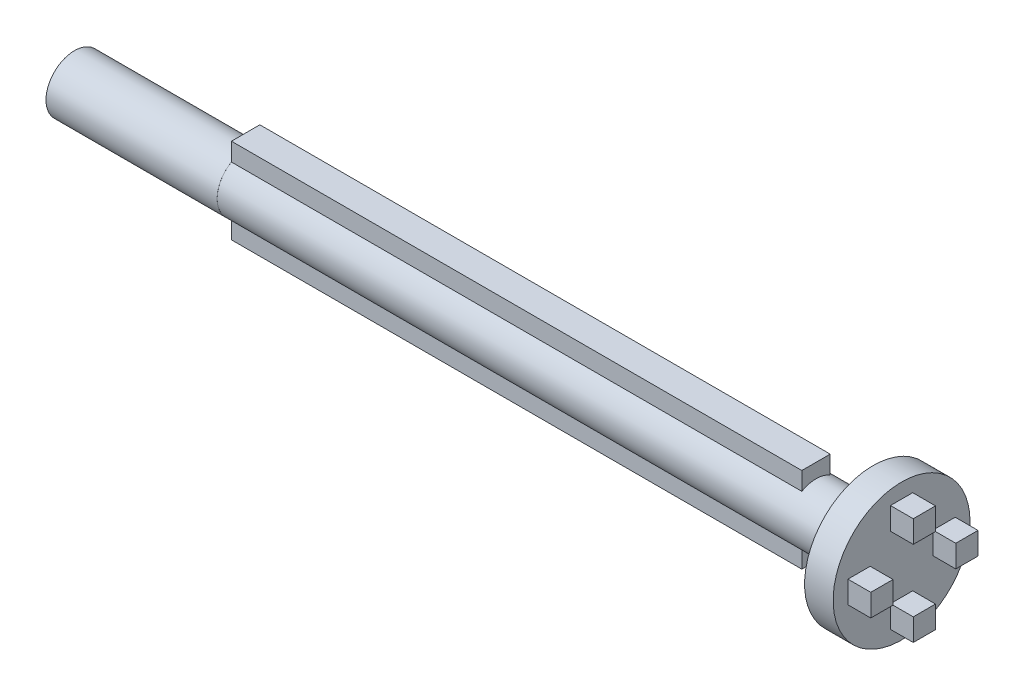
ISO-10303-21;
HEADER;
FILE_DESCRIPTION(('STEP AP214'),'2;1');
FILE_NAME('part.step','',(''),(''),'','','');
FILE_SCHEMA(('AUTOMOTIVE_DESIGN { 1 0 10303 214 1 1 1 1 }'));
ENDSEC;
DATA;
#1=APPLICATION_CONTEXT('core data for automotive mechanical design processes');
#2=APPLICATION_PROTOCOL_DEFINITION('international standard','automotive_design',2000,#1);
#3=PRODUCT_CONTEXT('',#1,'mechanical');
#4=PRODUCT('Part','Part','',(#3));
#5=PRODUCT_RELATED_PRODUCT_CATEGORY('part','',(#4));
#6=PRODUCT_DEFINITION_FORMATION('','',#4);
#7=PRODUCT_DEFINITION_CONTEXT('part definition',#1,'design');
#8=PRODUCT_DEFINITION('design','',#6,#7);
#9=PRODUCT_DEFINITION_SHAPE('','',#8);
#10=(LENGTH_UNIT() NAMED_UNIT(*) SI_UNIT(.MILLI.,.METRE.));
#11=(NAMED_UNIT(*) PLANE_ANGLE_UNIT() SI_UNIT($,.RADIAN.));
#12=(NAMED_UNIT(*) SI_UNIT($,.STERADIAN.) SOLID_ANGLE_UNIT());
#13=UNCERTAINTY_MEASURE_WITH_UNIT(LENGTH_MEASURE(1.E-05),#10,'distance_accuracy_value','');
#14=(GEOMETRIC_REPRESENTATION_CONTEXT(3) GLOBAL_UNCERTAINTY_ASSIGNED_CONTEXT((#13)) GLOBAL_UNIT_ASSIGNED_CONTEXT((#10,
#11,#12)) REPRESENTATION_CONTEXT('',''));
#15=CARTESIAN_POINT('',(0.,0.,0.));
#16=DIRECTION('',(0.,0.,1.));
#17=DIRECTION('',(1.,0.,0.));
#18=AXIS2_PLACEMENT_3D('',#15,#16,#17);
#19=CARTESIAN_POINT('',(0.,0.,0.));
#20=DIRECTION('',(1.,0.,0.));
#21=DIRECTION('',(0.,0.,-1.));
#22=AXIS2_PLACEMENT_3D('',#19,#20,#21);
#23=PLANE('',#22);
#24=CARTESIAN_POINT('',(0.,0.,0.));
#25=DIRECTION('',(-1.,0.,0.));
#26=DIRECTION('',(0.,0.,1.));
#27=AXIS2_PLACEMENT_3D('',#24,#25,#26);
#28=CIRCLE('',#27,5.);
#29=CARTESIAN_POINT('',(0.,4.33588514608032,2.49));
#30=VERTEX_POINT('',#29);
#31=CARTESIAN_POINT('',(0.,4.33588514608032,-2.49));
#32=VERTEX_POINT('',#31);
#33=EDGE_CURVE('E53',#30,#32,#28,.T.);
#34=ORIENTED_EDGE('',*,*,#33,.F.);
#35=DIRECTION('',(0.,-1.,0.));
#36=VECTOR('',#35,1.);
#37=CARTESIAN_POINT('',(0.,0.,2.49));
#38=LINE('',#37,#36);
#39=CARTESIAN_POINT('',(0.,7.49,2.49));
#40=VERTEX_POINT('',#39);
#41=EDGE_CURVE('E292',#40,#30,#38,.T.);
#42=ORIENTED_EDGE('',*,*,#41,.F.);
#43=DIRECTION('',(0.,0.,-1.));
#44=VECTOR('',#43,1.);
#45=CARTESIAN_POINT('',(0.,7.49,0.));
#46=LINE('',#45,#44);
#47=CARTESIAN_POINT('',(0.,7.49,-2.49));
#48=VERTEX_POINT('',#47);
#49=EDGE_CURVE('E288',#40,#48,#46,.T.);
#50=ORIENTED_EDGE('',*,*,#49,.T.);
#51=DIRECTION('',(0.,-1.,0.));
#52=VECTOR('',#51,1.);
#53=CARTESIAN_POINT('',(0.,0.,-2.49));
#54=LINE('',#53,#52);
#55=EDGE_CURVE('E286',#48,#32,#54,.T.);
#56=ORIENTED_EDGE('',*,*,#55,.T.);
#57=EDGE_LOOP('',(#34,#42,#50,#56));
#58=FACE_BOUND('',#57,.T.);
#59=ADVANCED_FACE('F43',(#58),#23,.F.);
#60=CARTESIAN_POINT('',(115.,0.,0.));
#61=DIRECTION('',(1.,0.,0.));
#62=DIRECTION('',(0.,0.,-1.));
#63=AXIS2_PLACEMENT_3D('',#60,#61,#62);
#64=PLANE('',#63);
#65=DIRECTION('',(0.,1.,0.));
#66=VECTOR('',#65,1.);
#67=CARTESIAN_POINT('',(115.,0.,1.95));
#68=LINE('',#67,#66);
#69=CARTESIAN_POINT('',(115.,-9.4,1.95));
#70=VERTEX_POINT('',#69);
#71=CARTESIAN_POINT('',(115.,-5.5,1.95));
#72=VERTEX_POINT('',#71);
#73=EDGE_CURVE('E350',#70,#72,#68,.T.);
#74=ORIENTED_EDGE('',*,*,#73,.T.);
#75=DIRECTION('',(0.,0.,-1.));
#76=VECTOR('',#75,1.);
#77=CARTESIAN_POINT('',(115.,-5.5,0.));
#78=LINE('',#77,#76);
#79=CARTESIAN_POINT('',(115.,-5.5,-1.95));
#80=VERTEX_POINT('',#79);
#81=EDGE_CURVE('E355',#72,#80,#78,.T.);
#82=ORIENTED_EDGE('',*,*,#81,.T.);
#83=DIRECTION('',(0.,1.,0.));
#84=VECTOR('',#83,1.);
#85=CARTESIAN_POINT('',(115.,0.,-1.95));
#86=LINE('',#85,#84);
#87=CARTESIAN_POINT('',(115.,-9.4,-1.95));
#88=VERTEX_POINT('',#87);
#89=EDGE_CURVE('E367',#88,#80,#86,.T.);
#90=ORIENTED_EDGE('',*,*,#89,.F.);
#91=DIRECTION('',(0.,0.,-1.));
#92=VECTOR('',#91,1.);
#93=CARTESIAN_POINT('',(115.,-9.4,0.));
#94=LINE('',#93,#92);
#95=EDGE_CURVE('E364',#70,#88,#94,.T.);
#96=ORIENTED_EDGE('',*,*,#95,.F.);
#97=EDGE_LOOP('',(#74,#82,#90,#96));
#98=FACE_BOUND('',#97,.T.);
#99=DIRECTION('',(0.,-1.,0.));
#100=VECTOR('',#99,1.);
#101=CARTESIAN_POINT('',(115.,0.,-1.95));
#102=LINE('',#101,#100);
#103=CARTESIAN_POINT('',(115.,9.4,-1.95));
#104=VERTEX_POINT('',#103);
#105=CARTESIAN_POINT('',(115.,5.5,-1.95));
#106=VERTEX_POINT('',#105);
#107=EDGE_CURVE('E415',#104,#106,#102,.T.);
#108=ORIENTED_EDGE('',*,*,#107,.T.);
#109=DIRECTION('',(0.,0.,-1.));
#110=VECTOR('',#109,1.);
#111=CARTESIAN_POINT('',(115.,5.5,0.));
#112=LINE('',#111,#110);
#113=CARTESIAN_POINT('',(115.,5.5,1.95));
#114=VERTEX_POINT('',#113);
#115=EDGE_CURVE('E420',#114,#106,#112,.T.);
#116=ORIENTED_EDGE('',*,*,#115,.F.);
#117=DIRECTION('',(0.,-1.,0.));
#118=VECTOR('',#117,1.);
#119=CARTESIAN_POINT('',(115.,0.,1.95));
#120=LINE('',#119,#118);
#121=CARTESIAN_POINT('',(115.,9.4,1.95));
#122=VERTEX_POINT('',#121);
#123=EDGE_CURVE('E433',#122,#114,#120,.T.);
#124=ORIENTED_EDGE('',*,*,#123,.F.);
#125=DIRECTION('',(0.,0.,-1.));
#126=VECTOR('',#125,1.);
#127=CARTESIAN_POINT('',(115.,9.4,0.));
#128=LINE('',#127,#126);
#129=EDGE_CURVE('E430',#122,#104,#128,.T.);
#130=ORIENTED_EDGE('',*,*,#129,.T.);
#131=EDGE_LOOP('',(#108,#116,#124,#130));
#132=FACE_BOUND('',#131,.T.);
#133=CARTESIAN_POINT('',(115.,0.,0.));
#134=DIRECTION('',(1.,0.,0.));
#135=DIRECTION('',(0.,0.,-1.));
#136=AXIS2_PLACEMENT_3D('',#133,#134,#135);
#137=CIRCLE('',#136,12.);
#138=CARTESIAN_POINT('',(115.,0.,-12.));
#139=VERTEX_POINT('',#138);
#140=EDGE_CURVE('E271',#139,#139,#137,.T.);
#141=ORIENTED_EDGE('',*,*,#140,.T.);
#142=EDGE_LOOP('',(#141));
#143=FACE_BOUND('',#142,.T.);
#144=DIRECTION('',(0.,1.,0.));
#145=VECTOR('',#144,1.);
#146=CARTESIAN_POINT('',(115.,0.,5.49999999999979));
#147=LINE('',#146,#145);
#148=CARTESIAN_POINT('',(115.,-1.9500000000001,5.49999999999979));
#149=VERTEX_POINT('',#148);
#150=CARTESIAN_POINT('',(115.,1.9499999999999,5.49999999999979));
#151=VERTEX_POINT('',#150);
#152=EDGE_CURVE('E398',#149,#151,#147,.T.);
#153=ORIENTED_EDGE('',*,*,#152,.F.);
#154=DIRECTION('',(0.,0.,-1.));
#155=VECTOR('',#154,1.);
#156=CARTESIAN_POINT('',(115.,-1.9500000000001,0.));
#157=LINE('',#156,#155);
#158=CARTESIAN_POINT('',(115.,-1.9500000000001,9.39999999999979));
#159=VERTEX_POINT('',#158);
#160=EDGE_CURVE('E382',#159,#149,#157,.T.);
#161=ORIENTED_EDGE('',*,*,#160,.F.);
#162=DIRECTION('',(0.,1.,0.));
#163=VECTOR('',#162,1.);
#164=CARTESIAN_POINT('',(115.,0.,9.39999999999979));
#165=LINE('',#164,#163);
#166=CARTESIAN_POINT('',(115.,1.9499999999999,9.39999999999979));
#167=VERTEX_POINT('',#166);
#168=EDGE_CURVE('E387',#159,#167,#165,.T.);
#169=ORIENTED_EDGE('',*,*,#168,.T.);
#170=DIRECTION('',(0.,0.,-1.));
#171=VECTOR('',#170,1.);
#172=CARTESIAN_POINT('',(115.,1.9499999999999,0.));
#173=LINE('',#172,#171);
#174=EDGE_CURVE('E401',#167,#151,#173,.T.);
#175=ORIENTED_EDGE('',*,*,#174,.T.);
#176=EDGE_LOOP('',(#153,#161,#169,#175));
#177=FACE_BOUND('',#176,.T.);
#178=DIRECTION('',(0.,-1.,0.));
#179=VECTOR('',#178,1.);
#180=CARTESIAN_POINT('',(115.,0.,-5.5000000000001));
#181=LINE('',#180,#179);
#182=CARTESIAN_POINT('',(115.,1.95000000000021,-5.5000000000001));
#183=VERTEX_POINT('',#182);
#184=CARTESIAN_POINT('',(115.,-1.94999999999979,-5.5000000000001));
#185=VERTEX_POINT('',#184);
#186=EDGE_CURVE('E333',#183,#185,#181,.T.);
#187=ORIENTED_EDGE('',*,*,#186,.F.);
#188=DIRECTION('',(0.,0.,1.));
#189=VECTOR('',#188,1.);
#190=CARTESIAN_POINT('',(115.,1.95000000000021,0.));
#191=LINE('',#190,#189);
#192=CARTESIAN_POINT('',(115.,1.95000000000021,-9.4000000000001));
#193=VERTEX_POINT('',#192);
#194=EDGE_CURVE('E314',#193,#183,#191,.T.);
#195=ORIENTED_EDGE('',*,*,#194,.F.);
#196=DIRECTION('',(0.,-1.,0.));
#197=VECTOR('',#196,1.);
#198=CARTESIAN_POINT('',(115.,0.,-9.4000000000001));
#199=LINE('',#198,#197);
#200=CARTESIAN_POINT('',(115.,-1.94999999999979,-9.4000000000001));
#201=VERTEX_POINT('',#200);
#202=EDGE_CURVE('E322',#193,#201,#199,.T.);
#203=ORIENTED_EDGE('',*,*,#202,.T.);
#204=DIRECTION('',(0.,0.,1.));
#205=VECTOR('',#204,1.);
#206=CARTESIAN_POINT('',(115.,-1.94999999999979,0.));
#207=LINE('',#206,#205);
#208=EDGE_CURVE('E336',#201,#185,#207,.T.);
#209=ORIENTED_EDGE('',*,*,#208,.T.);
#210=EDGE_LOOP('',(#187,#195,#203,#209));
#211=FACE_BOUND('',#210,.T.);
#212=ADVANCED_FACE('F466',(#98,#132,#143,#177,#211),#64,.T.);
#213=CARTESIAN_POINT('',(110.,0.,2.49));
#214=DIRECTION('',(0.,0.,-1.));
#215=DIRECTION('',(0.,1.,0.));
#216=AXIS2_PLACEMENT_3D('',#213,#214,#215);
#217=PLANE('',#216);
#218=DIRECTION('',(-1.,0.,0.));
#219=VECTOR('',#218,1.);
#220=CARTESIAN_POINT('',(110.,-7.49,2.49));
#221=LINE('',#220,#219);
#222=CARTESIAN_POINT('',(100.,-7.49,2.49));
#223=VERTEX_POINT('',#222);
#224=CARTESIAN_POINT('',(0.,-7.49,2.49));
#225=VERTEX_POINT('',#224);
#226=EDGE_CURVE('E252',#223,#225,#221,.T.);
#227=ORIENTED_EDGE('',*,*,#226,.F.);
#228=DIRECTION('',(0.,-1.,0.));
#229=VECTOR('',#228,1.);
#230=CARTESIAN_POINT('',(100.,0.,2.49));
#231=LINE('',#230,#229);
#232=CARTESIAN_POINT('',(100.,-4.32434966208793,2.49));
#233=VERTEX_POINT('',#232);
#234=EDGE_CURVE('E263',#233,#223,#231,.T.);
#235=ORIENTED_EDGE('',*,*,#234,.F.);
#236=DIRECTION('',(-1.,0.,0.));
#237=VECTOR('',#236,1.);
#238=CARTESIAN_POINT('',(110.,-4.32434966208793,2.49));
#239=LINE('',#238,#237);
#240=CARTESIAN_POINT('',(0.,-4.32434966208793,2.49));
#241=VERTEX_POINT('',#240);
#242=EDGE_CURVE('E47',#233,#241,#239,.T.);
#243=ORIENTED_EDGE('',*,*,#242,.T.);
#244=DIRECTION('',(0.,-1.,0.));
#245=VECTOR('',#244,1.);
#246=CARTESIAN_POINT('',(0.,0.,2.49));
#247=LINE('',#246,#245);
#248=CARTESIAN_POINT('',(0.,-4.33588514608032,2.49));
#249=VERTEX_POINT('',#248);
#250=EDGE_CURVE('E262',#241,#249,#247,.T.);
#251=ORIENTED_EDGE('',*,*,#250,.T.);
#252=EDGE_CURVE('E270',#249,#225,#247,.T.);
#253=ORIENTED_EDGE('',*,*,#252,.T.);
#254=EDGE_LOOP('',(#227,#235,#243,#251,#253));
#255=FACE_BOUND('',#254,.T.);
#256=ADVANCED_FACE('F45',(#255),#217,.F.);
#257=CARTESIAN_POINT('',(110.,-7.49,0.));
#258=DIRECTION('',(0.,1.,0.));
#259=DIRECTION('',(0.,0.,1.));
#260=AXIS2_PLACEMENT_3D('',#257,#258,#259);
#261=PLANE('',#260);
#262=DIRECTION('',(-1.,0.,0.));
#263=VECTOR('',#262,1.);
#264=CARTESIAN_POINT('',(110.,-7.49,-2.49));
#265=LINE('',#264,#263);
#266=CARTESIAN_POINT('',(100.,-7.49,-2.49));
#267=VERTEX_POINT('',#266);
#268=CARTESIAN_POINT('',(0.,-7.49,-2.49));
#269=VERTEX_POINT('',#268);
#270=EDGE_CURVE('E246',#267,#269,#265,.T.);
#271=ORIENTED_EDGE('',*,*,#270,.F.);
#272=DIRECTION('',(0.,0.,1.));
#273=VECTOR('',#272,1.);
#274=CARTESIAN_POINT('',(100.,-7.49,0.));
#275=LINE('',#274,#273);
#276=EDGE_CURVE('E817',#267,#223,#275,.T.);
#277=ORIENTED_EDGE('',*,*,#276,.T.);
#278=ORIENTED_EDGE('',*,*,#226,.T.);
#279=DIRECTION('',(0.,0.,-1.));
#280=VECTOR('',#279,1.);
#281=CARTESIAN_POINT('',(0.,-7.49,0.));
#282=LINE('',#281,#280);
#283=EDGE_CURVE('E276',#225,#269,#282,.T.);
#284=ORIENTED_EDGE('',*,*,#283,.T.);
#285=EDGE_LOOP('',(#271,#277,#278,#284));
#286=FACE_BOUND('',#285,.T.);
#287=ADVANCED_FACE('F462',(#286),#261,.F.);
#288=CARTESIAN_POINT('',(110.,0.,-2.49));
#289=DIRECTION('',(0.,0.,-1.));
#290=DIRECTION('',(0.,1.,0.));
#291=AXIS2_PLACEMENT_3D('',#288,#289,#290);
#292=PLANE('',#291);
#293=DIRECTION('',(0.,-1.,0.));
#294=VECTOR('',#293,1.);
#295=CARTESIAN_POINT('',(100.,0.,-2.49));
#296=LINE('',#295,#294);
#297=CARTESIAN_POINT('',(100.,-4.32434966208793,-2.49));
#298=VERTEX_POINT('',#297);
#299=EDGE_CURVE('E815',#298,#267,#296,.T.);
#300=ORIENTED_EDGE('',*,*,#299,.T.);
#301=ORIENTED_EDGE('',*,*,#270,.T.);
#302=DIRECTION('',(0.,-1.,0.));
#303=VECTOR('',#302,1.);
#304=CARTESIAN_POINT('',(0.,0.,-2.49));
#305=LINE('',#304,#303);
#306=CARTESIAN_POINT('',(0.,-4.33588514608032,-2.49));
#307=VERTEX_POINT('',#306);
#308=EDGE_CURVE('E278',#307,#269,#305,.T.);
#309=ORIENTED_EDGE('',*,*,#308,.F.);
#310=CARTESIAN_POINT('',(0.,-4.32434966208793,-2.49));
#311=VERTEX_POINT('',#310);
#312=EDGE_CURVE('E282',#311,#307,#305,.T.);
#313=ORIENTED_EDGE('',*,*,#312,.F.);
#314=DIRECTION('',(-1.,0.,0.));
#315=VECTOR('',#314,1.);
#316=CARTESIAN_POINT('',(110.,-4.32434966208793,-2.49));
#317=LINE('',#316,#315);
#318=EDGE_CURVE('E244',#298,#311,#317,.T.);
#319=ORIENTED_EDGE('',*,*,#318,.F.);
#320=EDGE_LOOP('',(#300,#301,#309,#313,#319));
#321=FACE_BOUND('',#320,.T.);
#322=ADVANCED_FACE('F455',(#321),#292,.T.);
#323=CARTESIAN_POINT('',(110.,0.,0.));
#324=DIRECTION('',(-1.,0.,0.));
#325=DIRECTION('',(0.,0.,1.));
#326=AXIS2_PLACEMENT_3D('',#323,#324,#325);
#327=CYLINDRICAL_SURFACE('',#326,4.99);
#328=ORIENTED_EDGE('',*,*,#242,.F.);
#329=CARTESIAN_POINT('',(100.,0.,0.));
#330=DIRECTION('',(-1.,0.,0.));
#331=DIRECTION('',(0.,0.,1.));
#332=AXIS2_PLACEMENT_3D('',#329,#330,#331);
#333=CIRCLE('',#332,4.99);
#334=EDGE_CURVE('E230',#298,#233,#333,.T.);
#335=ORIENTED_EDGE('',*,*,#334,.F.);
#336=ORIENTED_EDGE('',*,*,#318,.T.);
#337=CARTESIAN_POINT('',(0.,0.,0.));
#338=DIRECTION('',(1.,0.,0.));
#339=DIRECTION('',(0.,0.,-1.));
#340=AXIS2_PLACEMENT_3D('',#337,#338,#339);
#341=CIRCLE('',#340,4.99);
#342=CARTESIAN_POINT('',(0.,4.32434966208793,-2.49));
#343=VERTEX_POINT('',#342);
#344=EDGE_CURVE('E243',#311,#343,#341,.T.);
#345=ORIENTED_EDGE('',*,*,#344,.T.);
#346=DIRECTION('',(-1.,0.,0.));
#347=VECTOR('',#346,1.);
#348=CARTESIAN_POINT('',(110.,4.32434966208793,-2.49));
#349=LINE('',#348,#347);
#350=CARTESIAN_POINT('',(100.,4.32434966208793,-2.49));
#351=VERTEX_POINT('',#350);
#352=EDGE_CURVE('E234',#351,#343,#349,.T.);
#353=ORIENTED_EDGE('',*,*,#352,.F.);
#354=CARTESIAN_POINT('',(100.,0.,0.));
#355=DIRECTION('',(-1.,0.,0.));
#356=DIRECTION('',(0.,0.,1.));
#357=AXIS2_PLACEMENT_3D('',#354,#355,#356);
#358=CIRCLE('',#357,4.99);
#359=CARTESIAN_POINT('',(100.,4.32434966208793,2.49));
#360=VERTEX_POINT('',#359);
#361=EDGE_CURVE('E219',#360,#351,#358,.T.);
#362=ORIENTED_EDGE('',*,*,#361,.F.);
#363=DIRECTION('',(-1.,0.,0.));
#364=VECTOR('',#363,1.);
#365=CARTESIAN_POINT('',(110.,4.32434966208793,2.49));
#366=LINE('',#365,#364);
#367=CARTESIAN_POINT('',(0.,4.32434966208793,2.49));
#368=VERTEX_POINT('',#367);
#369=EDGE_CURVE('E266',#360,#368,#366,.T.);
#370=ORIENTED_EDGE('',*,*,#369,.T.);
#371=CARTESIAN_POINT('',(0.,0.,0.));
#372=DIRECTION('',(1.,0.,0.));
#373=DIRECTION('',(0.,0.,-1.));
#374=AXIS2_PLACEMENT_3D('',#371,#372,#373);
#375=CIRCLE('',#374,4.99);
#376=EDGE_CURVE('E265',#368,#241,#375,.T.);
#377=ORIENTED_EDGE('',*,*,#376,.T.);
#378=EDGE_LOOP('',(#328,#335,#336,#345,#353,#362,#370,#377));
#379=FACE_BOUND('',#378,.T.);
#380=CARTESIAN_POINT('',(110.,0.,0.));
#381=DIRECTION('',(1.,0.,0.));
#382=DIRECTION('',(0.,0.,-1.));
#383=AXIS2_PLACEMENT_3D('',#380,#381,#382);
#384=CIRCLE('',#383,4.99);
#385=CARTESIAN_POINT('',(110.,0.,-4.99));
#386=VERTEX_POINT('',#385);
#387=EDGE_CURVE('E295',#386,#386,#384,.T.);
#388=ORIENTED_EDGE('',*,*,#387,.F.);
#389=EDGE_LOOP('',(#388));
#390=FACE_BOUND('',#389,.T.);
#391=ADVANCED_FACE('F240',(#379,#390),#327,.T.);
#392=CARTESIAN_POINT('',(110.,0.,-2.49));
#393=DIRECTION('',(0.,0.,-1.));
#394=DIRECTION('',(0.,1.,0.));
#395=AXIS2_PLACEMENT_3D('',#392,#393,#394);
#396=PLANE('',#395);
#397=DIRECTION('',(0.,-1.,0.));
#398=VECTOR('',#397,1.);
#399=CARTESIAN_POINT('',(100.,0.,-2.49));
#400=LINE('',#399,#398);
#401=CARTESIAN_POINT('',(100.,7.49,-2.49));
#402=VERTEX_POINT('',#401);
#403=EDGE_CURVE('E222',#402,#351,#400,.T.);
#404=ORIENTED_EDGE('',*,*,#403,.T.);
#405=ORIENTED_EDGE('',*,*,#352,.T.);
#406=EDGE_CURVE('E67',#32,#343,#54,.T.);
#407=ORIENTED_EDGE('',*,*,#406,.F.);
#408=ORIENTED_EDGE('',*,*,#55,.F.);
#409=DIRECTION('',(-1.,0.,0.));
#410=VECTOR('',#409,1.);
#411=CARTESIAN_POINT('',(110.,7.49,-2.49));
#412=LINE('',#411,#410);
#413=EDGE_CURVE('E236',#402,#48,#412,.T.);
#414=ORIENTED_EDGE('',*,*,#413,.F.);
#415=EDGE_LOOP('',(#404,#405,#407,#408,#414));
#416=FACE_BOUND('',#415,.T.);
#417=ADVANCED_FACE('F233',(#416),#396,.T.);
#418=CARTESIAN_POINT('',(110.,7.49,0.));
#419=DIRECTION('',(0.,1.,0.));
#420=DIRECTION('',(0.,0.,1.));
#421=AXIS2_PLACEMENT_3D('',#418,#419,#420);
#422=PLANE('',#421);
#423=DIRECTION('',(0.,0.,1.));
#424=VECTOR('',#423,1.);
#425=CARTESIAN_POINT('',(100.,7.49,0.));
#426=LINE('',#425,#424);
#427=CARTESIAN_POINT('',(100.,7.49,2.49));
#428=VERTEX_POINT('',#427);
#429=EDGE_CURVE('E229',#402,#428,#426,.T.);
#430=ORIENTED_EDGE('',*,*,#429,.F.);
#431=ORIENTED_EDGE('',*,*,#413,.T.);
#432=ORIENTED_EDGE('',*,*,#49,.F.);
#433=DIRECTION('',(-1.,0.,0.));
#434=VECTOR('',#433,1.);
#435=CARTESIAN_POINT('',(110.,7.49,2.49));
#436=LINE('',#435,#434);
#437=EDGE_CURVE('E248',#428,#40,#436,.T.);
#438=ORIENTED_EDGE('',*,*,#437,.F.);
#439=EDGE_LOOP('',(#430,#431,#432,#438));
#440=FACE_BOUND('',#439,.T.);
#441=ADVANCED_FACE('F304',(#440),#422,.T.);
#442=CARTESIAN_POINT('',(110.,0.,2.49));
#443=DIRECTION('',(0.,0.,-1.));
#444=DIRECTION('',(0.,1.,0.));
#445=AXIS2_PLACEMENT_3D('',#442,#443,#444);
#446=PLANE('',#445);
#447=ORIENTED_EDGE('',*,*,#369,.F.);
#448=DIRECTION('',(0.,-1.,0.));
#449=VECTOR('',#448,1.);
#450=CARTESIAN_POINT('',(100.,0.,2.49));
#451=LINE('',#450,#449);
#452=EDGE_CURVE('E225',#428,#360,#451,.T.);
#453=ORIENTED_EDGE('',*,*,#452,.F.);
#454=ORIENTED_EDGE('',*,*,#437,.T.);
#455=ORIENTED_EDGE('',*,*,#41,.T.);
#456=EDGE_CURVE('E291',#30,#368,#38,.T.);
#457=ORIENTED_EDGE('',*,*,#456,.T.);
#458=EDGE_LOOP('',(#447,#453,#454,#455,#457));
#459=FACE_BOUND('',#458,.T.);
#460=ADVANCED_FACE('F299',(#459),#446,.F.);
#461=EDGE_CURVE('E11',#307,#249,#28,.T.);
#462=ORIENTED_EDGE('',*,*,#461,.F.);
#463=ORIENTED_EDGE('',*,*,#308,.T.);
#464=ORIENTED_EDGE('',*,*,#283,.F.);
#465=ORIENTED_EDGE('',*,*,#252,.F.);
#466=EDGE_LOOP('',(#462,#463,#464,#465));
#467=FACE_BOUND('',#466,.T.);
#468=ADVANCED_FACE('F468',(#467),#23,.F.);
#469=CARTESIAN_POINT('',(110.,0.,0.));
#470=DIRECTION('',(1.,0.,0.));
#471=DIRECTION('',(0.,0.,-1.));
#472=AXIS2_PLACEMENT_3D('',#469,#470,#471);
#473=PLANE('',#472);
#474=ORIENTED_EDGE('',*,*,#387,.T.);
#475=EDGE_LOOP('',(#474));
#476=FACE_BOUND('',#475,.T.);
#477=CARTESIAN_POINT('',(110.,0.,0.));
#478=DIRECTION('',(1.,0.,0.));
#479=DIRECTION('',(0.,0.,-1.));
#480=AXIS2_PLACEMENT_3D('',#477,#478,#479);
#481=CIRCLE('',#480,12.);
#482=CARTESIAN_POINT('',(110.,0.,-12.));
#483=VERTEX_POINT('',#482);
#484=EDGE_CURVE('E445',#483,#483,#481,.T.);
#485=ORIENTED_EDGE('',*,*,#484,.F.);
#486=EDGE_LOOP('',(#485));
#487=FACE_BOUND('',#486,.T.);
#488=ADVANCED_FACE('F452',(#476,#487),#473,.F.);
#489=CARTESIAN_POINT('',(115.,0.,0.));
#490=DIRECTION('',(-1.,0.,0.));
#491=DIRECTION('',(0.,0.,1.));
#492=AXIS2_PLACEMENT_3D('',#489,#490,#491);
#493=CYLINDRICAL_SURFACE('',#492,12.);
#494=ORIENTED_EDGE('',*,*,#140,.F.);
#495=EDGE_LOOP('',(#494));
#496=FACE_BOUND('',#495,.T.);
#497=ORIENTED_EDGE('',*,*,#484,.T.);
#498=EDGE_LOOP('',(#497));
#499=FACE_BOUND('',#498,.T.);
#500=ADVANCED_FACE('F482',(#496,#499),#493,.T.);
#501=CARTESIAN_POINT('',(119.,0.,-1.95));
#502=DIRECTION('',(0.,0.,-1.));
#503=DIRECTION('',(0.,1.,0.));
#504=AXIS2_PLACEMENT_3D('',#501,#502,#503);
#505=PLANE('',#504);
#506=ORIENTED_EDGE('',*,*,#107,.F.);
#507=DIRECTION('',(-1.,0.,0.));
#508=VECTOR('',#507,1.);
#509=CARTESIAN_POINT('',(119.,9.4,-1.95));
#510=LINE('',#509,#508);
#511=CARTESIAN_POINT('',(119.,9.4,-1.95));
#512=VERTEX_POINT('',#511);
#513=EDGE_CURVE('E443',#512,#104,#510,.T.);
#514=ORIENTED_EDGE('',*,*,#513,.F.);
#515=DIRECTION('',(0.,-1.,0.));
#516=VECTOR('',#515,1.);
#517=CARTESIAN_POINT('',(119.,0.,-1.95));
#518=LINE('',#517,#516);
#519=CARTESIAN_POINT('',(119.,5.5,-1.95));
#520=VERTEX_POINT('',#519);
#521=EDGE_CURVE('E416',#512,#520,#518,.T.);
#522=ORIENTED_EDGE('',*,*,#521,.T.);
#523=DIRECTION('',(-1.,0.,0.));
#524=VECTOR('',#523,1.);
#525=CARTESIAN_POINT('',(119.,5.5,-1.95));
#526=LINE('',#525,#524);
#527=EDGE_CURVE('E427',#520,#106,#526,.T.);
#528=ORIENTED_EDGE('',*,*,#527,.T.);
#529=EDGE_LOOP('',(#506,#514,#522,#528));
#530=FACE_BOUND('',#529,.T.);
#531=ADVANCED_FACE('F740',(#530),#505,.T.);
#532=CARTESIAN_POINT('',(119.,9.4,0.));
#533=DIRECTION('',(0.,1.,0.));
#534=DIRECTION('',(0.,0.,1.));
#535=AXIS2_PLACEMENT_3D('',#532,#533,#534);
#536=PLANE('',#535);
#537=ORIENTED_EDGE('',*,*,#129,.F.);
#538=DIRECTION('',(-1.,0.,0.));
#539=VECTOR('',#538,1.);
#540=CARTESIAN_POINT('',(119.,9.4,1.95));
#541=LINE('',#540,#539);
#542=CARTESIAN_POINT('',(119.,9.4,1.95));
#543=VERTEX_POINT('',#542);
#544=EDGE_CURVE('E441',#543,#122,#541,.T.);
#545=ORIENTED_EDGE('',*,*,#544,.F.);
#546=DIRECTION('',(0.,0.,-1.));
#547=VECTOR('',#546,1.);
#548=CARTESIAN_POINT('',(119.,9.4,0.));
#549=LINE('',#548,#547);
#550=EDGE_CURVE('E419',#543,#512,#549,.T.);
#551=ORIENTED_EDGE('',*,*,#550,.T.);
#552=ORIENTED_EDGE('',*,*,#513,.T.);
#553=EDGE_LOOP('',(#537,#545,#551,#552));
#554=FACE_BOUND('',#553,.T.);
#555=ADVANCED_FACE('F731',(#554),#536,.T.);
#556=CARTESIAN_POINT('',(119.,0.,1.95));
#557=DIRECTION('',(0.,0.,-1.));
#558=DIRECTION('',(-1.,0.,0.));
#559=AXIS2_PLACEMENT_3D('',#556,#557,#558);
#560=PLANE('',#559);
#561=ORIENTED_EDGE('',*,*,#123,.T.);
#562=DIRECTION('',(-1.,0.,0.));
#563=VECTOR('',#562,1.);
#564=CARTESIAN_POINT('',(119.,5.5,1.95));
#565=LINE('',#564,#563);
#566=CARTESIAN_POINT('',(119.,5.5,1.95));
#567=VERTEX_POINT('',#566);
#568=EDGE_CURVE('E439',#567,#114,#565,.T.);
#569=ORIENTED_EDGE('',*,*,#568,.F.);
#570=DIRECTION('',(0.,-1.,0.));
#571=VECTOR('',#570,1.);
#572=CARTESIAN_POINT('',(119.,0.,1.95));
#573=LINE('',#572,#571);
#574=EDGE_CURVE('E423',#543,#567,#573,.T.);
#575=ORIENTED_EDGE('',*,*,#574,.F.);
#576=ORIENTED_EDGE('',*,*,#544,.T.);
#577=EDGE_LOOP('',(#561,#569,#575,#576));
#578=FACE_BOUND('',#577,.T.);
#579=ADVANCED_FACE('F722',(#578),#560,.F.);
#580=CARTESIAN_POINT('',(119.,5.5,0.));
#581=DIRECTION('',(0.,1.,0.));
#582=DIRECTION('',(0.,0.,1.));
#583=AXIS2_PLACEMENT_3D('',#580,#581,#582);
#584=PLANE('',#583);
#585=ORIENTED_EDGE('',*,*,#115,.T.);
#586=ORIENTED_EDGE('',*,*,#527,.F.);
#587=DIRECTION('',(0.,0.,-1.));
#588=VECTOR('',#587,1.);
#589=CARTESIAN_POINT('',(119.,5.5,0.));
#590=LINE('',#589,#588);
#591=EDGE_CURVE('E425',#567,#520,#590,.T.);
#592=ORIENTED_EDGE('',*,*,#591,.F.);
#593=ORIENTED_EDGE('',*,*,#568,.T.);
#594=EDGE_LOOP('',(#585,#586,#592,#593));
#595=FACE_BOUND('',#594,.T.);
#596=ADVANCED_FACE('F713',(#595),#584,.F.);
#597=CARTESIAN_POINT('',(119.,0.,0.));
#598=DIRECTION('',(1.,0.,0.));
#599=DIRECTION('',(0.,0.,-1.));
#600=AXIS2_PLACEMENT_3D('',#597,#598,#599);
#601=PLANE('',#600);
#602=ORIENTED_EDGE('',*,*,#521,.F.);
#603=ORIENTED_EDGE('',*,*,#550,.F.);
#604=ORIENTED_EDGE('',*,*,#574,.T.);
#605=ORIENTED_EDGE('',*,*,#591,.T.);
#606=EDGE_LOOP('',(#602,#603,#604,#605));
#607=FACE_BOUND('',#606,.T.);
#608=ADVANCED_FACE('F704',(#607),#601,.T.);
#609=CARTESIAN_POINT('',(119.,-1.9500000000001,0.));
#610=DIRECTION('',(0.,1.,0.));
#611=DIRECTION('',(0.,0.,1.));
#612=AXIS2_PLACEMENT_3D('',#609,#610,#611);
#613=PLANE('',#612);
#614=ORIENTED_EDGE('',*,*,#160,.T.);
#615=DIRECTION('',(-1.,0.,0.));
#616=VECTOR('',#615,1.);
#617=CARTESIAN_POINT('',(119.,-1.9500000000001,5.49999999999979));
#618=LINE('',#617,#616);
#619=CARTESIAN_POINT('',(119.,-1.9500000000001,5.49999999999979));
#620=VERTEX_POINT('',#619);
#621=EDGE_CURVE('E412',#620,#149,#618,.T.);
#622=ORIENTED_EDGE('',*,*,#621,.F.);
#623=DIRECTION('',(0.,0.,-1.));
#624=VECTOR('',#623,1.);
#625=CARTESIAN_POINT('',(119.,-1.9500000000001,0.));
#626=LINE('',#625,#624);
#627=CARTESIAN_POINT('',(119.,-1.9500000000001,9.39999999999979));
#628=VERTEX_POINT('',#627);
#629=EDGE_CURVE('E383',#628,#620,#626,.T.);
#630=ORIENTED_EDGE('',*,*,#629,.F.);
#631=DIRECTION('',(-1.,0.,0.));
#632=VECTOR('',#631,1.);
#633=CARTESIAN_POINT('',(119.,-1.9500000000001,9.39999999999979));
#634=LINE('',#633,#632);
#635=EDGE_CURVE('E395',#628,#159,#634,.T.);
#636=ORIENTED_EDGE('',*,*,#635,.T.);
#637=EDGE_LOOP('',(#614,#622,#630,#636));
#638=FACE_BOUND('',#637,.T.);
#639=ADVANCED_FACE('F695',(#638),#613,.F.);
#640=CARTESIAN_POINT('',(119.,0.,5.49999999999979));
#641=DIRECTION('',(0.,0.,1.));
#642=DIRECTION('',(1.,0.,0.));
#643=AXIS2_PLACEMENT_3D('',#640,#641,#642);
#644=PLANE('',#643);
#645=ORIENTED_EDGE('',*,*,#152,.T.);
#646=DIRECTION('',(-1.,0.,0.));
#647=VECTOR('',#646,1.);
#648=CARTESIAN_POINT('',(119.,1.9499999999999,5.49999999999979));
#649=LINE('',#648,#647);
#650=CARTESIAN_POINT('',(119.,1.9499999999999,5.49999999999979));
#651=VERTEX_POINT('',#650);
#652=EDGE_CURVE('E409',#651,#151,#649,.T.);
#653=ORIENTED_EDGE('',*,*,#652,.F.);
#654=DIRECTION('',(0.,1.,0.));
#655=VECTOR('',#654,1.);
#656=CARTESIAN_POINT('',(119.,0.,5.49999999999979));
#657=LINE('',#656,#655);
#658=EDGE_CURVE('E386',#620,#651,#657,.T.);
#659=ORIENTED_EDGE('',*,*,#658,.F.);
#660=ORIENTED_EDGE('',*,*,#621,.T.);
#661=EDGE_LOOP('',(#645,#653,#659,#660));
#662=FACE_BOUND('',#661,.T.);
#663=ADVANCED_FACE('F686',(#662),#644,.F.);
#664=CARTESIAN_POINT('',(119.,1.9499999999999,0.));
#665=DIRECTION('',(0.,1.,0.));
#666=DIRECTION('',(0.,0.,1.));
#667=AXIS2_PLACEMENT_3D('',#664,#665,#666);
#668=PLANE('',#667);
#669=ORIENTED_EDGE('',*,*,#174,.F.);
#670=DIRECTION('',(-1.,0.,0.));
#671=VECTOR('',#670,1.);
#672=CARTESIAN_POINT('',(119.,1.9499999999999,9.39999999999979));
#673=LINE('',#672,#671);
#674=CARTESIAN_POINT('',(119.,1.9499999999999,9.39999999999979));
#675=VERTEX_POINT('',#674);
#676=EDGE_CURVE('E406',#675,#167,#673,.T.);
#677=ORIENTED_EDGE('',*,*,#676,.F.);
#678=DIRECTION('',(0.,0.,-1.));
#679=VECTOR('',#678,1.);
#680=CARTESIAN_POINT('',(119.,1.9499999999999,0.));
#681=LINE('',#680,#679);
#682=EDGE_CURVE('E389',#675,#651,#681,.T.);
#683=ORIENTED_EDGE('',*,*,#682,.T.);
#684=ORIENTED_EDGE('',*,*,#652,.T.);
#685=EDGE_LOOP('',(#669,#677,#683,#684));
#686=FACE_BOUND('',#685,.T.);
#687=ADVANCED_FACE('F677',(#686),#668,.T.);
#688=CARTESIAN_POINT('',(119.,0.,9.39999999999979));
#689=DIRECTION('',(0.,0.,1.));
#690=DIRECTION('',(1.,0.,0.));
#691=AXIS2_PLACEMENT_3D('',#688,#689,#690);
#692=PLANE('',#691);
#693=ORIENTED_EDGE('',*,*,#168,.F.);
#694=ORIENTED_EDGE('',*,*,#635,.F.);
#695=DIRECTION('',(0.,1.,0.));
#696=VECTOR('',#695,1.);
#697=CARTESIAN_POINT('',(119.,0.,9.39999999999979));
#698=LINE('',#697,#696);
#699=EDGE_CURVE('E392',#628,#675,#698,.T.);
#700=ORIENTED_EDGE('',*,*,#699,.T.);
#701=ORIENTED_EDGE('',*,*,#676,.T.);
#702=EDGE_LOOP('',(#693,#694,#700,#701));
#703=FACE_BOUND('',#702,.T.);
#704=ADVANCED_FACE('F668',(#703),#692,.T.);
#705=CARTESIAN_POINT('',(119.,0.,0.));
#706=DIRECTION('',(1.,0.,0.));
#707=DIRECTION('',(0.,0.,-1.));
#708=AXIS2_PLACEMENT_3D('',#705,#706,#707);
#709=PLANE('',#708);
#710=ORIENTED_EDGE('',*,*,#629,.T.);
#711=ORIENTED_EDGE('',*,*,#658,.T.);
#712=ORIENTED_EDGE('',*,*,#682,.F.);
#713=ORIENTED_EDGE('',*,*,#699,.F.);
#714=EDGE_LOOP('',(#710,#711,#712,#713));
#715=FACE_BOUND('',#714,.T.);
#716=ADVANCED_FACE('F659',(#715),#709,.T.);
#717=CARTESIAN_POINT('',(119.,0.,1.95));
#718=DIRECTION('',(0.,0.,1.));
#719=DIRECTION('',(1.,0.,0.));
#720=AXIS2_PLACEMENT_3D('',#717,#718,#719);
#721=PLANE('',#720);
#722=ORIENTED_EDGE('',*,*,#73,.F.);
#723=DIRECTION('',(-1.,0.,0.));
#724=VECTOR('',#723,1.);
#725=CARTESIAN_POINT('',(119.,-9.4,1.95));
#726=LINE('',#725,#724);
#727=CARTESIAN_POINT('',(119.,-9.4,1.95));
#728=VERTEX_POINT('',#727);
#729=EDGE_CURVE('E379',#728,#70,#726,.T.);
#730=ORIENTED_EDGE('',*,*,#729,.F.);
#731=DIRECTION('',(0.,1.,0.));
#732=VECTOR('',#731,1.);
#733=CARTESIAN_POINT('',(119.,0.,1.95));
#734=LINE('',#733,#732);
#735=CARTESIAN_POINT('',(119.,-5.5,1.95));
#736=VERTEX_POINT('',#735);
#737=EDGE_CURVE('E351',#728,#736,#734,.T.);
#738=ORIENTED_EDGE('',*,*,#737,.T.);
#739=DIRECTION('',(-1.,0.,0.));
#740=VECTOR('',#739,1.);
#741=CARTESIAN_POINT('',(119.,-5.5,1.95));
#742=LINE('',#741,#740);
#743=EDGE_CURVE('E362',#736,#72,#742,.T.);
#744=ORIENTED_EDGE('',*,*,#743,.T.);
#745=EDGE_LOOP('',(#722,#730,#738,#744));
#746=FACE_BOUND('',#745,.T.);
#747=ADVANCED_FACE('F649',(#746),#721,.T.);
#748=CARTESIAN_POINT('',(119.,-9.4,0.));
#749=DIRECTION('',(0.,1.,0.));
#750=DIRECTION('',(0.,0.,1.));
#751=AXIS2_PLACEMENT_3D('',#748,#749,#750);
#752=PLANE('',#751);
#753=ORIENTED_EDGE('',*,*,#95,.T.);
#754=DIRECTION('',(-1.,0.,0.));
#755=VECTOR('',#754,1.);
#756=CARTESIAN_POINT('',(119.,-9.4,-1.95));
#757=LINE('',#756,#755);
#758=CARTESIAN_POINT('',(119.,-9.4,-1.95));
#759=VERTEX_POINT('',#758);
#760=EDGE_CURVE('E376',#759,#88,#757,.T.);
#761=ORIENTED_EDGE('',*,*,#760,.F.);
#762=DIRECTION('',(0.,0.,-1.));
#763=VECTOR('',#762,1.);
#764=CARTESIAN_POINT('',(119.,-9.4,0.));
#765=LINE('',#764,#763);
#766=EDGE_CURVE('E354',#728,#759,#765,.T.);
#767=ORIENTED_EDGE('',*,*,#766,.F.);
#768=ORIENTED_EDGE('',*,*,#729,.T.);
#769=EDGE_LOOP('',(#753,#761,#767,#768));
#770=FACE_BOUND('',#769,.T.);
#771=ADVANCED_FACE('F639',(#770),#752,.F.);
#772=CARTESIAN_POINT('',(119.,0.,-1.95));
#773=DIRECTION('',(0.,0.,1.));
#774=DIRECTION('',(0.,-1.,0.));
#775=AXIS2_PLACEMENT_3D('',#772,#773,#774);
#776=PLANE('',#775);
#777=ORIENTED_EDGE('',*,*,#89,.T.);
#778=DIRECTION('',(-1.,0.,0.));
#779=VECTOR('',#778,1.);
#780=CARTESIAN_POINT('',(119.,-5.5,-1.95));
#781=LINE('',#780,#779);
#782=CARTESIAN_POINT('',(119.,-5.5,-1.95));
#783=VERTEX_POINT('',#782);
#784=EDGE_CURVE('E373',#783,#80,#781,.T.);
#785=ORIENTED_EDGE('',*,*,#784,.F.);
#786=DIRECTION('',(0.,1.,0.));
#787=VECTOR('',#786,1.);
#788=CARTESIAN_POINT('',(119.,0.,-1.95));
#789=LINE('',#788,#787);
#790=EDGE_CURVE('E357',#759,#783,#789,.T.);
#791=ORIENTED_EDGE('',*,*,#790,.F.);
#792=ORIENTED_EDGE('',*,*,#760,.T.);
#793=EDGE_LOOP('',(#777,#785,#791,#792));
#794=FACE_BOUND('',#793,.T.);
#795=ADVANCED_FACE('F629',(#794),#776,.F.);
#796=CARTESIAN_POINT('',(119.,-5.5,0.));
#797=DIRECTION('',(0.,1.,0.));
#798=DIRECTION('',(0.,0.,1.));
#799=AXIS2_PLACEMENT_3D('',#796,#797,#798);
#800=PLANE('',#799);
#801=ORIENTED_EDGE('',*,*,#81,.F.);
#802=ORIENTED_EDGE('',*,*,#743,.F.);
#803=DIRECTION('',(0.,0.,-1.));
#804=VECTOR('',#803,1.);
#805=CARTESIAN_POINT('',(119.,-5.5,0.));
#806=LINE('',#805,#804);
#807=EDGE_CURVE('E359',#736,#783,#806,.T.);
#808=ORIENTED_EDGE('',*,*,#807,.T.);
#809=ORIENTED_EDGE('',*,*,#784,.T.);
#810=EDGE_LOOP('',(#801,#802,#808,#809));
#811=FACE_BOUND('',#810,.T.);
#812=ADVANCED_FACE('F619',(#811),#800,.T.);
#813=CARTESIAN_POINT('',(119.,0.,0.));
#814=DIRECTION('',(1.,0.,0.));
#815=DIRECTION('',(0.,0.,-1.));
#816=AXIS2_PLACEMENT_3D('',#813,#814,#815);
#817=PLANE('',#816);
#818=ORIENTED_EDGE('',*,*,#737,.F.);
#819=ORIENTED_EDGE('',*,*,#766,.T.);
#820=ORIENTED_EDGE('',*,*,#790,.T.);
#821=ORIENTED_EDGE('',*,*,#807,.F.);
#822=EDGE_LOOP('',(#818,#819,#820,#821));
#823=FACE_BOUND('',#822,.T.);
#824=ADVANCED_FACE('F610',(#823),#817,.T.);
#825=CARTESIAN_POINT('',(119.,1.95000000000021,0.));
#826=DIRECTION('',(0.,-1.,0.));
#827=DIRECTION('',(0.,0.,-1.));
#828=AXIS2_PLACEMENT_3D('',#825,#826,#827);
#829=PLANE('',#828);
#830=ORIENTED_EDGE('',*,*,#194,.T.);
#831=DIRECTION('',(-1.,0.,0.));
#832=VECTOR('',#831,1.);
#833=CARTESIAN_POINT('',(119.,1.95000000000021,-5.5000000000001));
#834=LINE('',#833,#832);
#835=CARTESIAN_POINT('',(119.,1.95000000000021,-5.5000000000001));
#836=VERTEX_POINT('',#835);
#837=EDGE_CURVE('E347',#836,#183,#834,.T.);
#838=ORIENTED_EDGE('',*,*,#837,.F.);
#839=DIRECTION('',(0.,0.,1.));
#840=VECTOR('',#839,1.);
#841=CARTESIAN_POINT('',(119.,1.95000000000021,0.));
#842=LINE('',#841,#840);
#843=CARTESIAN_POINT('',(119.,1.95000000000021,-9.4000000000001));
#844=VERTEX_POINT('',#843);
#845=EDGE_CURVE('E318',#844,#836,#842,.T.);
#846=ORIENTED_EDGE('',*,*,#845,.F.);
#847=DIRECTION('',(-1.,0.,0.));
#848=VECTOR('',#847,1.);
#849=CARTESIAN_POINT('',(119.,1.95000000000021,-9.4000000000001));
#850=LINE('',#849,#848);
#851=EDGE_CURVE('E330',#844,#193,#850,.T.);
#852=ORIENTED_EDGE('',*,*,#851,.T.);
#853=EDGE_LOOP('',(#830,#838,#846,#852));
#854=FACE_BOUND('',#853,.T.);
#855=ADVANCED_FACE('F601',(#854),#829,.F.);
#856=CARTESIAN_POINT('',(119.,0.,-5.5000000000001));
#857=DIRECTION('',(0.,0.,-1.));
#858=DIRECTION('',(-1.,0.,0.));
#859=AXIS2_PLACEMENT_3D('',#856,#857,#858);
#860=PLANE('',#859);
#861=ORIENTED_EDGE('',*,*,#186,.T.);
#862=DIRECTION('',(-1.,0.,0.));
#863=VECTOR('',#862,1.);
#864=CARTESIAN_POINT('',(119.,-1.94999999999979,-5.5000000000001));
#865=LINE('',#864,#863);
#866=CARTESIAN_POINT('',(119.,-1.94999999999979,-5.5000000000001));
#867=VERTEX_POINT('',#866);
#868=EDGE_CURVE('E344',#867,#185,#865,.T.);
#869=ORIENTED_EDGE('',*,*,#868,.F.);
#870=DIRECTION('',(0.,-1.,0.));
#871=VECTOR('',#870,1.);
#872=CARTESIAN_POINT('',(119.,0.,-5.5000000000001));
#873=LINE('',#872,#871);
#874=EDGE_CURVE('E321',#836,#867,#873,.T.);
#875=ORIENTED_EDGE('',*,*,#874,.F.);
#876=ORIENTED_EDGE('',*,*,#837,.T.);
#877=EDGE_LOOP('',(#861,#869,#875,#876));
#878=FACE_BOUND('',#877,.T.);
#879=ADVANCED_FACE('F592',(#878),#860,.F.);
#880=CARTESIAN_POINT('',(119.,-1.94999999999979,0.));
#881=DIRECTION('',(0.,-1.,0.));
#882=DIRECTION('',(0.,0.,-1.));
#883=AXIS2_PLACEMENT_3D('',#880,#881,#882);
#884=PLANE('',#883);
#885=ORIENTED_EDGE('',*,*,#208,.F.);
#886=DIRECTION('',(-1.,0.,0.));
#887=VECTOR('',#886,1.);
#888=CARTESIAN_POINT('',(119.,-1.94999999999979,-9.4000000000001));
#889=LINE('',#888,#887);
#890=CARTESIAN_POINT('',(119.,-1.94999999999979,-9.4000000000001));
#891=VERTEX_POINT('',#890);
#892=EDGE_CURVE('E341',#891,#201,#889,.T.);
#893=ORIENTED_EDGE('',*,*,#892,.F.);
#894=DIRECTION('',(0.,0.,1.));
#895=VECTOR('',#894,1.);
#896=CARTESIAN_POINT('',(119.,-1.94999999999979,0.));
#897=LINE('',#896,#895);
#898=EDGE_CURVE('E324',#891,#867,#897,.T.);
#899=ORIENTED_EDGE('',*,*,#898,.T.);
#900=ORIENTED_EDGE('',*,*,#868,.T.);
#901=EDGE_LOOP('',(#885,#893,#899,#900));
#902=FACE_BOUND('',#901,.T.);
#903=ADVANCED_FACE('F583',(#902),#884,.T.);
#904=CARTESIAN_POINT('',(119.,0.,-9.4000000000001));
#905=DIRECTION('',(0.,0.,-1.));
#906=DIRECTION('',(-1.,0.,0.));
#907=AXIS2_PLACEMENT_3D('',#904,#905,#906);
#908=PLANE('',#907);
#909=ORIENTED_EDGE('',*,*,#202,.F.);
#910=ORIENTED_EDGE('',*,*,#851,.F.);
#911=DIRECTION('',(0.,-1.,0.));
#912=VECTOR('',#911,1.);
#913=CARTESIAN_POINT('',(119.,0.,-9.4000000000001));
#914=LINE('',#913,#912);
#915=EDGE_CURVE('E327',#844,#891,#914,.T.);
#916=ORIENTED_EDGE('',*,*,#915,.T.);
#917=ORIENTED_EDGE('',*,*,#892,.T.);
#918=EDGE_LOOP('',(#909,#910,#916,#917));
#919=FACE_BOUND('',#918,.T.);
#920=ADVANCED_FACE('F573',(#919),#908,.T.);
#921=CARTESIAN_POINT('',(119.,0.,0.));
#922=DIRECTION('',(1.,0.,0.));
#923=DIRECTION('',(0.,0.,-1.));
#924=AXIS2_PLACEMENT_3D('',#921,#922,#923);
#925=PLANE('',#924);
#926=ORIENTED_EDGE('',*,*,#845,.T.);
#927=ORIENTED_EDGE('',*,*,#874,.T.);
#928=ORIENTED_EDGE('',*,*,#898,.F.);
#929=ORIENTED_EDGE('',*,*,#915,.F.);
#930=EDGE_LOOP('',(#926,#927,#928,#929));
#931=FACE_BOUND('',#930,.T.);
#932=ADVANCED_FACE('F556',(#931),#925,.T.);
#933=CARTESIAN_POINT('',(0.,0.,0.));
#934=DIRECTION('',(-1.,0.,0.));
#935=DIRECTION('',(0.,0.,1.));
#936=AXIS2_PLACEMENT_3D('',#933,#934,#935);
#937=PLANE('',#936);
#938=EDGE_CURVE('E54',#32,#307,#28,.T.);
#939=ORIENTED_EDGE('',*,*,#938,.F.);
#940=ORIENTED_EDGE('',*,*,#406,.T.);
#941=ORIENTED_EDGE('',*,*,#344,.F.);
#942=ORIENTED_EDGE('',*,*,#312,.T.);
#943=EDGE_LOOP('',(#939,#940,#941,#942));
#944=FACE_BOUND('',#943,.T.);
#945=ADVANCED_FACE('F308',(#944),#937,.F.);
#946=CARTESIAN_POINT('',(-30.,0.,0.));
#947=DIRECTION('',(1.,0.,0.));
#948=DIRECTION('',(0.,0.,-1.));
#949=AXIS2_PLACEMENT_3D('',#946,#947,#948);
#950=CYLINDRICAL_SURFACE('',#949,5.);
#951=CARTESIAN_POINT('',(-30.,0.,0.));
#952=DIRECTION('',(-1.,0.,0.));
#953=DIRECTION('',(0.,0.,1.));
#954=AXIS2_PLACEMENT_3D('',#951,#952,#953);
#955=CIRCLE('',#954,5.);
#956=CARTESIAN_POINT('',(-30.,0.,5.));
#957=VERTEX_POINT('',#956);
#958=EDGE_CURVE('E312',#957,#957,#955,.T.);
#959=ORIENTED_EDGE('',*,*,#958,.F.);
#960=EDGE_LOOP('',(#959));
#961=FACE_BOUND('',#960,.T.);
#962=ORIENTED_EDGE('',*,*,#33,.T.);
#963=ORIENTED_EDGE('',*,*,#938,.T.);
#964=ORIENTED_EDGE('',*,*,#461,.T.);
#965=EDGE_CURVE('E237',#249,#30,#28,.T.);
#966=ORIENTED_EDGE('',*,*,#965,.T.);
#967=EDGE_LOOP('',(#962,#963,#964,#966));
#968=FACE_BOUND('',#967,.T.);
#969=ADVANCED_FACE('F311',(#961,#968),#950,.T.);
#970=CARTESIAN_POINT('',(-30.,0.,0.));
#971=DIRECTION('',(-1.,0.,0.));
#972=DIRECTION('',(0.,0.,1.));
#973=AXIS2_PLACEMENT_3D('',#970,#971,#972);
#974=PLANE('',#973);
#975=ORIENTED_EDGE('',*,*,#958,.T.);
#976=EDGE_LOOP('',(#975));
#977=FACE_BOUND('',#976,.T.);
#978=ADVANCED_FACE('F534',(#977),#974,.T.);
#979=ORIENTED_EDGE('',*,*,#456,.F.);
#980=ORIENTED_EDGE('',*,*,#965,.F.);
#981=ORIENTED_EDGE('',*,*,#250,.F.);
#982=ORIENTED_EDGE('',*,*,#376,.F.);
#983=EDGE_LOOP('',(#979,#980,#981,#982));
#984=FACE_BOUND('',#983,.T.);
#985=ADVANCED_FACE('F274',(#984),#937,.F.);
#986=CARTESIAN_POINT('',(100.,0.,0.));
#987=DIRECTION('',(-1.,0.,0.));
#988=DIRECTION('',(0.,0.,1.));
#989=AXIS2_PLACEMENT_3D('',#986,#987,#988);
#990=PLANE('',#989);
#991=ORIENTED_EDGE('',*,*,#334,.T.);
#992=ORIENTED_EDGE('',*,*,#234,.T.);
#993=ORIENTED_EDGE('',*,*,#276,.F.);
#994=ORIENTED_EDGE('',*,*,#299,.F.);
#995=EDGE_LOOP('',(#991,#992,#993,#994));
#996=FACE_BOUND('',#995,.T.);
#997=ADVANCED_FACE('F533',(#996),#990,.F.);
#998=CARTESIAN_POINT('',(100.,0.,0.));
#999=DIRECTION('',(-1.,0.,0.));
#1000=DIRECTION('',(0.,0.,1.));
#1001=AXIS2_PLACEMENT_3D('',#998,#999,#1000);
#1002=PLANE('',#1001);
#1003=ORIENTED_EDGE('',*,*,#361,.T.);
#1004=ORIENTED_EDGE('',*,*,#403,.F.);
#1005=ORIENTED_EDGE('',*,*,#429,.T.);
#1006=ORIENTED_EDGE('',*,*,#452,.T.);
#1007=EDGE_LOOP('',(#1003,#1004,#1005,#1006));
#1008=FACE_BOUND('',#1007,.T.);
#1009=ADVANCED_FACE('F221',(#1008),#1002,.F.);
#1010=CLOSED_SHELL('',(#59,#212,#256,#287,#322,#391,#417,#441,#460,#468,#488,#500,#531,#555,
#579,#596,#608,#639,#663,#687,#704,#716,#747,#771,#795,#812,#824,#855,#879,#903,#920,#932,#945,
#969,#978,#985,#997,#1009));
#1011=MANIFOLD_SOLID_BREP('B2',#1010);
#1012=ADVANCED_BREP_SHAPE_REPRESENTATION('',(#18,#1011),#14);
#1013=SHAPE_DEFINITION_REPRESENTATION(#9,#1012);
ENDSEC;
END-ISO-10303-21;
